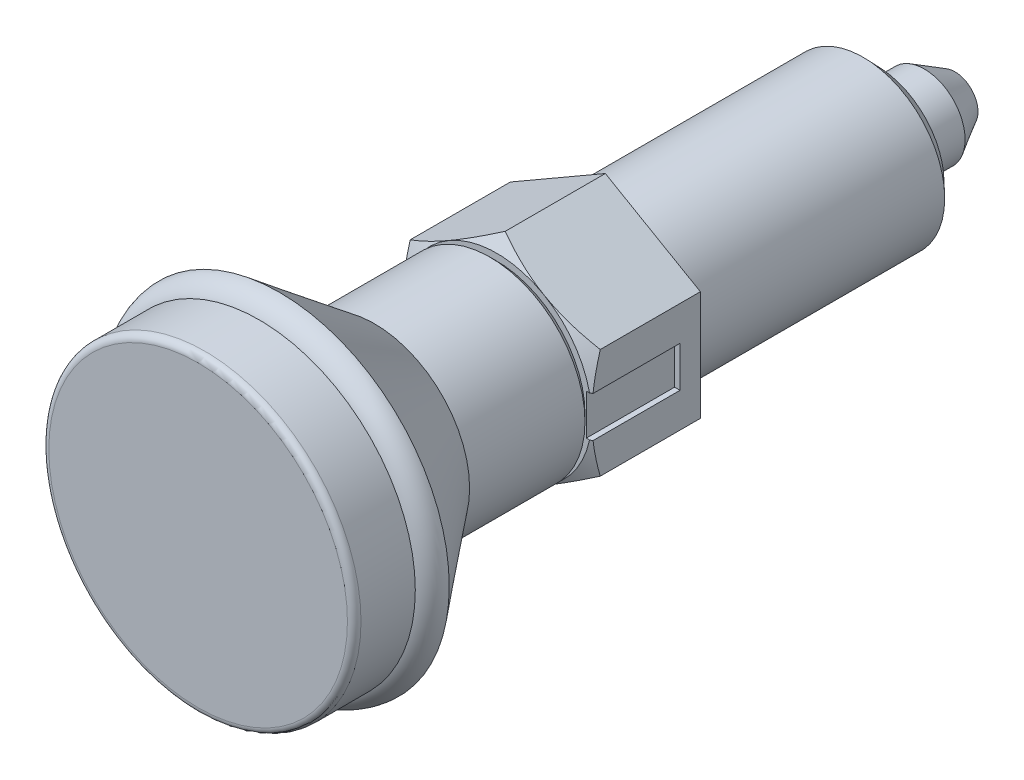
ISO-10303-21;
HEADER;
FILE_DESCRIPTION(('STEP AP214'),'2;1');
FILE_NAME('part.step','',(''),(''),'','','');
FILE_SCHEMA(('AUTOMOTIVE_DESIGN { 1 0 10303 214 1 1 1 1 }'));
ENDSEC;
DATA;
#1=APPLICATION_CONTEXT('core data for automotive mechanical design processes');
#2=APPLICATION_PROTOCOL_DEFINITION('international standard','automotive_design',2000,#1);
#3=PRODUCT_CONTEXT('',#1,'mechanical');
#4=PRODUCT('Part','Part','',(#3));
#5=PRODUCT_RELATED_PRODUCT_CATEGORY('part','',(#4));
#6=PRODUCT_DEFINITION_FORMATION('','',#4);
#7=PRODUCT_DEFINITION_CONTEXT('part definition',#1,'design');
#8=PRODUCT_DEFINITION('design','',#6,#7);
#9=PRODUCT_DEFINITION_SHAPE('','',#8);
#10=(LENGTH_UNIT() NAMED_UNIT(*) SI_UNIT(.MILLI.,.METRE.));
#11=(NAMED_UNIT(*) PLANE_ANGLE_UNIT() SI_UNIT($,.RADIAN.));
#12=(NAMED_UNIT(*) SI_UNIT($,.STERADIAN.) SOLID_ANGLE_UNIT());
#13=UNCERTAINTY_MEASURE_WITH_UNIT(LENGTH_MEASURE(1.E-05),#10,'distance_accuracy_value','');
#14=(GEOMETRIC_REPRESENTATION_CONTEXT(3) GLOBAL_UNCERTAINTY_ASSIGNED_CONTEXT((#13)) GLOBAL_UNIT_ASSIGNED_CONTEXT((#10,
#11,#12)) REPRESENTATION_CONTEXT('',''));
#15=CARTESIAN_POINT('',(0.,0.,0.));
#16=DIRECTION('',(0.,0.,1.));
#17=DIRECTION('',(1.,0.,0.));
#18=AXIS2_PLACEMENT_3D('',#15,#16,#17);
#19=CARTESIAN_POINT('',(0.,0.,7.99999999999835));
#20=DIRECTION('',(0.,0.,-1.));
#21=DIRECTION('',(-1.,0.,0.));
#22=AXIS2_PLACEMENT_3D('',#19,#20,#21);
#23=CONICAL_SURFACE('',#22,6.99999999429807,1.04719755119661);
#24=CARTESIAN_POINT('',(7.,-10.7185259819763,4.6503130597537));
#25=CARTESIAN_POINT('',(7.,-10.4111863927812,4.79883652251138));
#26=CARTESIAN_POINT('',(7.,-10.1031201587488,4.9458835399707));
#27=CARTESIAN_POINT('',(7.,-9.4851414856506,5.23618099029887));
#28=CARTESIAN_POINT('',(7.,-9.17522873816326,5.37943076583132));
#29=CARTESIAN_POINT('',(7.,-8.55148999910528,5.66204468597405));
#30=CARTESIAN_POINT('',(7.,-8.23765176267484,5.80138190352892));
#31=CARTESIAN_POINT('',(7.,-7.60739587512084,6.07407147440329));
#32=CARTESIAN_POINT('',(7.,-7.29097835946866,6.20742413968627));
#33=CARTESIAN_POINT('',(7.,-6.65113230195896,6.46813635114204));
#34=CARTESIAN_POINT('',(7.,-6.32766537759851,6.59540222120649));
#35=CARTESIAN_POINT('',(7.,-5.67691706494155,6.83996662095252));
#36=CARTESIAN_POINT('',(7.,-5.34963525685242,6.95726404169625));
#37=CARTESIAN_POINT('',(7.,-4.69140465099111,7.17873933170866));
#38=CARTESIAN_POINT('',(7.,-4.36046534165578,7.28294509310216));
#39=CARTESIAN_POINT('',(7.,-3.69389387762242,7.47485451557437));
#40=CARTESIAN_POINT('',(7.,-3.35826324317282,7.56256339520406));
#41=CARTESIAN_POINT('',(7.,-2.68202380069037,7.71721463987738));
#42=CARTESIAN_POINT('',(7.,-2.34141369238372,7.78415147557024));
#43=CARTESIAN_POINT('',(7.,-1.82750129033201,7.86562610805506));
#44=CARTESIAN_POINT('',(7.,-1.65567653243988,7.88963098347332));
#45=CARTESIAN_POINT('',(7.,-1.31122142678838,7.93085821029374));
#46=CARTESIAN_POINT('',(7.,-1.13859116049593,7.94808123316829));
#47=CARTESIAN_POINT('',(7.,-0.793853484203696,7.97528126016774));
#48=CARTESIAN_POINT('',(7.,-0.621749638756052,7.98530325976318));
#49=CARTESIAN_POINT('',(7.,-0.277271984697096,7.99804825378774));
#50=CARTESIAN_POINT('',(7.,-0.104898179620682,8.00077134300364));
#51=CARTESIAN_POINT('',(7.,0.239760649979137,7.99885363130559));
#52=CARTESIAN_POINT('',(7.,0.412045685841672,7.99421489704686));
#53=CARTESIAN_POINT('',(7.,0.756270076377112,7.97768889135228));
#54=CARTESIAN_POINT('',(7.,0.928209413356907,7.96580125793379));
#55=CARTESIAN_POINT('',(7.,1.34493742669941,7.92845253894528));
#56=CARTESIAN_POINT('',(7.,1.58940592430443,7.89935949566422));
#57=CARTESIAN_POINT('',(7.,2.07646958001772,7.82813397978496));
#58=CARTESIAN_POINT('',(7.,2.31906420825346,7.78599794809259));
#59=CARTESIAN_POINT('',(7.,2.80217998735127,7.69018088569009));
#60=CARTESIAN_POINT('',(7.,3.04269895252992,7.63648893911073));
#61=CARTESIAN_POINT('',(7.,3.52126228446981,7.51919825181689));
#62=CARTESIAN_POINT('',(7.,3.75930688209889,7.45560044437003));
#63=CARTESIAN_POINT('',(7.,4.23878446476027,7.31835710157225));
#64=CARTESIAN_POINT('',(7.,4.48015747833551,7.24450348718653));
#65=CARTESIAN_POINT('',(7.,4.96035218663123,7.08949909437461));
#66=CARTESIAN_POINT('',(7.,5.19917551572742,7.00835334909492));
#67=CARTESIAN_POINT('',(7.,5.67331254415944,6.8404408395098));
#68=CARTESIAN_POINT('',(7.,5.90863843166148,6.75370828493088));
#69=CARTESIAN_POINT('',(7.,6.37746440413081,6.5751524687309));
#70=CARTESIAN_POINT('',(7.,6.61096370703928,6.48332714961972));
#71=CARTESIAN_POINT('',(7.,6.84361473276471,6.38945923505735));
#72=B_SPLINE_CURVE_WITH_KNOTS('',3,(#24,#25,#26,#27,#28,#29,#30,#31,#32,#33,#34,#35,#36,#37,#38,
#39,#40,#41,#42,#43,#44,#45,#46,#47,#48,#49,#50,#51,#52,#53,#54,#55,#56,#57,#58,#59,#60,#61,#62,
#63,#64,#65,#66,#67,#68,#69,#70,#71),.UNSPECIFIED.,.F.,.F.,(4,2,2,2,2,2,2,2,2,2,2,2,2,2,2,2,2,2,
2,2,2,2,2,4),(0.,1.02405063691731,2.04827740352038,3.07836540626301,4.10839964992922,
5.15107951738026,6.19387522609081,7.23441013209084,8.27461532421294,9.31509717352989,
9.83546471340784,10.3557807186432,10.8728165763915,11.3898457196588,11.906729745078,
12.4236395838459,13.1618088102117,13.9001796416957,14.6392510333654,15.3782528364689,
16.1353691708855,16.8919668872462,17.6443059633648,18.3969512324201),.UNSPECIFIED.);
#73=CARTESIAN_POINT('',(7.,-4.04145188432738,7.37478521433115));
#74=VERTEX_POINT('',#73);
#75=CARTESIAN_POINT('',(7.,-1.5,7.90825295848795));
#76=VERTEX_POINT('',#75);
#77=EDGE_CURVE('E302',#74,#76,#72,.T.);
#78=ORIENTED_EDGE('',*,*,#77,.T.);
#79=CARTESIAN_POINT('',(8.17241147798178,-1.5,7.24428919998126));
#80=CARTESIAN_POINT('',(7.9635457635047,-1.5,7.36289231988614));
#81=CARTESIAN_POINT('',(7.75461997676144,-1.5,7.48138983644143));
#82=CARTESIAN_POINT('',(7.33660774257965,-1.5,7.71809952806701));
#83=CARTESIAN_POINT('',(7.12752129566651,-1.5,7.83631170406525));
#84=CARTESIAN_POINT('',(6.70914554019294,-1.5,8.0723775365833));
#85=CARTESIAN_POINT('',(6.49985623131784,-1.5,8.19023119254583));
#86=CARTESIAN_POINT('',(6.0810046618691,-1.5,8.42545397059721));
#87=CARTESIAN_POINT('',(5.87144240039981,-1.5,8.54282309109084));
#88=CARTESIAN_POINT('',(5.66170914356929,-1.5,8.6598866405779));
#89=B_SPLINE_CURVE_WITH_KNOTS('',3,(#79,#80,#81,#82,#83,#84,#85,#86,#87,#88),.UNSPECIFIED.,.F.,
.F.,(4,2,2,2,4),(0.,0.720572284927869,1.44114222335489,2.16171328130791,2.88228670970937),.UNSPECIFIED.);
#90=CARTESIAN_POINT('',(6.83739715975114,-1.5,7.99999999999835));
#91=VERTEX_POINT('',#90);
#92=EDGE_CURVE('E146',#76,#91,#89,.T.);
#93=ORIENTED_EDGE('',*,*,#92,.T.);
#94=CARTESIAN_POINT('',(0.,0.,7.99999999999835));
#95=DIRECTION('',(0.,0.,1.));
#96=DIRECTION('',(1.,0.,0.));
#97=AXIS2_PLACEMENT_3D('',#94,#95,#96);
#98=CIRCLE('',#97,6.99999999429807);
#99=CARTESIAN_POINT('',(3.5,-6.06217782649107,7.99999999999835));
#100=VERTEX_POINT('',#99);
#101=EDGE_CURVE('E404',#100,#91,#98,.T.);
#102=ORIENTED_EDGE('',*,*,#101,.F.);
#103=CARTESIAN_POINT('',(-0.000200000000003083,-8.0830192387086,7.37471854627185));
#104=CARTESIAN_POINT('',(0.153667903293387,-7.99418356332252,7.42600014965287));
#105=CARTESIAN_POINT('',(0.308109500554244,-7.90501666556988,7.47495440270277));
#106=CARTESIAN_POINT('',(0.618246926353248,-7.72595873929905,7.56756720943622));
#107=CARTESIAN_POINT('',(0.773943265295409,-7.63606741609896,7.61122347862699));
#108=CARTESIAN_POINT('',(1.24352516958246,-7.36495417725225,7.73338840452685));
#109=CARTESIAN_POINT('',(1.55926433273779,-7.18266208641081,7.80287443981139));
#110=CARTESIAN_POINT('',(2.03176224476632,-6.90986528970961,7.88435504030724));
#111=CARTESIAN_POINT('',(2.18710922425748,-6.82017566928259,7.90756651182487));
#112=CARTESIAN_POINT('',(2.49850511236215,-6.64039116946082,7.94648878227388));
#113=CARTESIAN_POINT('',(2.6545539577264,-6.55029632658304,7.96220024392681));
#114=CARTESIAN_POINT('',(2.96692267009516,-6.36995016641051,7.98572208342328));
#115=CARTESIAN_POINT('',(3.12324202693,-6.27969914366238,7.99354142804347));
#116=CARTESIAN_POINT('',(3.43601650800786,-6.09911871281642,8.00111975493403));
#117=CARTESIAN_POINT('',(3.59247162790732,-6.00878930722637,8.00087898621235));
#118=CARTESIAN_POINT('',(4.02110687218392,-5.76131663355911,7.98914026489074));
#119=CARTESIAN_POINT('',(4.29314668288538,-5.60425437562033,7.96943425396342));
#120=CARTESIAN_POINT('',(4.83541944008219,-5.29117305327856,7.90694653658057));
#121=CARTESIAN_POINT('',(5.10565047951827,-5.13515508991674,7.86414347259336));
#122=CARTESIAN_POINT('',(5.64901454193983,-4.82144370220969,7.75714831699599));
#123=CARTESIAN_POINT('',(5.92207900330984,-4.66378986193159,7.69250290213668));
#124=CARTESIAN_POINT('',(6.46413578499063,-4.35083323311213,7.54578392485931));
#125=CARTESIAN_POINT('',(6.73313504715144,-4.19552643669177,7.46374482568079));
#126=CARTESIAN_POINT('',(7.0002,-4.04133641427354,7.37471854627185));
#127=B_SPLINE_CURVE_WITH_KNOTS('',3,(#103,#104,#105,#106,#107,#108,#109,#110,#111,#112,#113,
#114,#115,#116,#117,#118,#119,#120,#121,#122,#123,#124,#125,#126),.UNSPECIFIED.,.F.,.F.,(4,2,2,
2,2,2,2,2,2,2,2,4),(0.,0.554727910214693,1.10969417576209,2.22193274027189,2.76443041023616,
3.30688013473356,3.84871284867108,4.39052882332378,5.33376515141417,6.27787517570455,
7.2429241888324,8.20607866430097),.UNSPECIFIED.);
#128=EDGE_CURVE('E294',#100,#74,#127,.T.);
#129=ORIENTED_EDGE('',*,*,#128,.T.);
#130=EDGE_LOOP('',(#78,#93,#102,#129));
#131=FACE_BOUND('',#130,.T.);
#132=ADVANCED_FACE('F14',(#131),#23,.T.);
#133=CARTESIAN_POINT('',(6.83739715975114,1.5,7.99999999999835));
#134=VERTEX_POINT('',#133);
#135=CARTESIAN_POINT('',(3.5,6.06217782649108,7.99999999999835));
#136=VERTEX_POINT('',#135);
#137=EDGE_CURVE('E407',#134,#136,#98,.T.);
#138=ORIENTED_EDGE('',*,*,#137,.F.);
#139=CARTESIAN_POINT('',(5.66170914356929,1.5,8.6598866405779));
#140=CARTESIAN_POINT('',(5.87144240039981,1.5,8.54282309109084));
#141=CARTESIAN_POINT('',(6.0810046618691,1.5,8.42545397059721));
#142=CARTESIAN_POINT('',(6.49985623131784,1.5,8.19023119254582));
#143=CARTESIAN_POINT('',(6.70914554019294,1.5,8.0723775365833));
#144=CARTESIAN_POINT('',(7.12752129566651,1.5,7.83631170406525));
#145=CARTESIAN_POINT('',(7.33660774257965,1.5,7.71809952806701));
#146=CARTESIAN_POINT('',(7.75461997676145,1.5,7.48138983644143));
#147=CARTESIAN_POINT('',(7.96354576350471,1.5,7.36289231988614));
#148=CARTESIAN_POINT('',(8.17241147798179,1.5,7.24428919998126));
#149=B_SPLINE_CURVE_WITH_KNOTS('',3,(#139,#140,#141,#142,#143,#144,#145,#146,#147,#148),
.UNSPECIFIED.,.F.,.F.,(4,2,2,2,4),(0.,0.720573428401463,1.44114448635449,2.16171442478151,
2.88228670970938),.UNSPECIFIED.);
#150=CARTESIAN_POINT('',(7.,1.5,7.90825295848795));
#151=VERTEX_POINT('',#150);
#152=EDGE_CURVE('E154',#134,#151,#149,.T.);
#153=ORIENTED_EDGE('',*,*,#152,.T.);
#154=CARTESIAN_POINT('',(7.,4.04145188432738,7.37478521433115));
#155=VERTEX_POINT('',#154);
#156=EDGE_CURVE('E270',#151,#155,#72,.T.);
#157=ORIENTED_EDGE('',*,*,#156,.T.);
#158=CARTESIAN_POINT('',(7.0002,4.04133641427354,7.37471854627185));
#159=CARTESIAN_POINT('',(6.84633209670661,4.13017208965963,7.42600014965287));
#160=CARTESIAN_POINT('',(6.69189049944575,4.21933898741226,7.47495440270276));
#161=CARTESIAN_POINT('',(6.38175307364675,4.39839691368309,7.56756720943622));
#162=CARTESIAN_POINT('',(6.22605673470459,4.48828823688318,7.61122347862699));
#163=CARTESIAN_POINT('',(5.75647483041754,4.75940147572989,7.73338840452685));
#164=CARTESIAN_POINT('',(5.4407356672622,4.94169356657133,7.80287443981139));
#165=CARTESIAN_POINT('',(4.96823775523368,5.21449036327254,7.88435504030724));
#166=CARTESIAN_POINT('',(4.81289077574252,5.30417998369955,7.90756651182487));
#167=CARTESIAN_POINT('',(4.50149488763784,5.48396448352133,7.94648878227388));
#168=CARTESIAN_POINT('',(4.3454460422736,5.57405932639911,7.96220024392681));
#169=CARTESIAN_POINT('',(4.03307732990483,5.75440548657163,7.98572208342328));
#170=CARTESIAN_POINT('',(3.87675797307,5.84465650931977,7.99354142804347));
#171=CARTESIAN_POINT('',(3.56398349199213,6.02523694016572,8.00111975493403));
#172=CARTESIAN_POINT('',(3.40752837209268,6.11556634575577,8.00087898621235));
#173=CARTESIAN_POINT('',(2.97889312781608,6.36303901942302,7.98914026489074));
#174=CARTESIAN_POINT('',(2.70685331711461,6.52010127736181,7.96943425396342));
#175=CARTESIAN_POINT('',(2.16458055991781,6.83318259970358,7.90694653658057));
#176=CARTESIAN_POINT('',(1.89434952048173,6.9892005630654,7.86414347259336));
#177=CARTESIAN_POINT('',(1.35098545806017,7.30291195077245,7.75714831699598));
#178=CARTESIAN_POINT('',(1.07792099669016,7.46056579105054,7.69250290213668));
#179=CARTESIAN_POINT('',(0.535864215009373,7.77352241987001,7.54578392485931));
#180=CARTESIAN_POINT('',(0.266864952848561,7.92882921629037,7.46374482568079));
#181=CARTESIAN_POINT('',(-0.000199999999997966,8.0830192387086,7.37471854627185));
#182=B_SPLINE_CURVE_WITH_KNOTS('',3,(#158,#159,#160,#161,#162,#163,#164,#165,#166,#167,#168,
#169,#170,#171,#172,#173,#174,#175,#176,#177,#178,#179,#180,#181),.UNSPECIFIED.,.F.,.F.,(4,2,2,
2,2,2,2,2,2,2,2,4),(0.,0.554727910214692,1.10969417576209,2.22193274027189,2.76443041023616,
3.30688013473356,3.84871284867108,4.39052882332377,5.33376515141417,6.27787517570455,
7.24292418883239,8.20607866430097),.UNSPECIFIED.);
#183=EDGE_CURVE('E269',#155,#136,#182,.T.);
#184=ORIENTED_EDGE('',*,*,#183,.T.);
#185=EDGE_LOOP('',(#138,#153,#157,#184));
#186=FACE_BOUND('',#185,.T.);
#187=ADVANCED_FACE('F368',(#186),#23,.T.);
#188=CARTESIAN_POINT('',(0.,6.99999999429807,7.99999999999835));
#189=DIRECTION('',(0.,0.,1.));
#190=DIRECTION('',(1.,0.,0.));
#191=AXIS2_PLACEMENT_3D('',#188,#189,#190);
#192=PLANE('',#191);
#193=CARTESIAN_POINT('',(0.,0.,7.99999999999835));
#194=DIRECTION('',(0.,0.,1.));
#195=DIRECTION('',(1.,0.,0.));
#196=AXIS2_PLACEMENT_3D('',#193,#194,#195);
#197=CIRCLE('',#196,6.49999999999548);
#198=CARTESIAN_POINT('',(6.49999999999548,0.,7.99999999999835));
#199=VERTEX_POINT('',#198);
#200=EDGE_CURVE('E417',#199,#199,#197,.T.);
#201=ORIENTED_EDGE('',*,*,#200,.F.);
#202=EDGE_LOOP('',(#201));
#203=FACE_BOUND('',#202,.T.);
#204=ORIENTED_EDGE('',*,*,#101,.T.);
#205=DIRECTION('',(1.,0.,0.));
#206=VECTOR('',#205,1.);
#207=CARTESIAN_POINT('',(6.6,-1.5,7.99999999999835));
#208=LINE('',#207,#206);
#209=CARTESIAN_POINT('',(6.6,-1.5,7.99999999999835));
#210=VERTEX_POINT('',#209);
#211=EDGE_CURVE('E155',#210,#91,#208,.T.);
#212=ORIENTED_EDGE('',*,*,#211,.F.);
#213=DIRECTION('',(0.,1.,0.));
#214=VECTOR('',#213,1.);
#215=CARTESIAN_POINT('',(6.6,-1.5,7.99999999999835));
#216=LINE('',#215,#214);
#217=CARTESIAN_POINT('',(6.6,1.5,7.99999999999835));
#218=VERTEX_POINT('',#217);
#219=EDGE_CURVE('E164',#210,#218,#216,.T.);
#220=ORIENTED_EDGE('',*,*,#219,.T.);
#221=DIRECTION('',(1.,0.,0.));
#222=VECTOR('',#221,1.);
#223=CARTESIAN_POINT('',(6.6,1.5,7.99999999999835));
#224=LINE('',#223,#222);
#225=EDGE_CURVE('E171',#218,#134,#224,.T.);
#226=ORIENTED_EDGE('',*,*,#225,.T.);
#227=ORIENTED_EDGE('',*,*,#137,.T.);
#228=CARTESIAN_POINT('',(-3.5,6.06217782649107,7.99999999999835));
#229=VERTEX_POINT('',#228);
#230=EDGE_CURVE('E412',#136,#229,#98,.T.);
#231=ORIENTED_EDGE('',*,*,#230,.T.);
#232=CARTESIAN_POINT('',(-6.83739715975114,1.5,7.99999999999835));
#233=VERTEX_POINT('',#232);
#234=EDGE_CURVE('E406',#229,#233,#98,.T.);
#235=ORIENTED_EDGE('',*,*,#234,.T.);
#236=DIRECTION('',(-1.,0.,0.));
#237=VECTOR('',#236,1.);
#238=CARTESIAN_POINT('',(-6.6,1.5,7.99999999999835));
#239=LINE('',#238,#237);
#240=CARTESIAN_POINT('',(-6.6,1.5,7.99999999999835));
#241=VERTEX_POINT('',#240);
#242=EDGE_CURVE('E450',#241,#233,#239,.T.);
#243=ORIENTED_EDGE('',*,*,#242,.F.);
#244=DIRECTION('',(0.,1.,0.));
#245=VECTOR('',#244,1.);
#246=CARTESIAN_POINT('',(-6.6,-1.5,7.99999999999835));
#247=LINE('',#246,#245);
#248=CARTESIAN_POINT('',(-6.6,-1.5,7.99999999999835));
#249=VERTEX_POINT('',#248);
#250=EDGE_CURVE('E461',#249,#241,#247,.T.);
#251=ORIENTED_EDGE('',*,*,#250,.F.);
#252=DIRECTION('',(-1.,0.,0.));
#253=VECTOR('',#252,1.);
#254=CARTESIAN_POINT('',(-6.6,-1.5,7.99999999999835));
#255=LINE('',#254,#253);
#256=CARTESIAN_POINT('',(-6.83739715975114,-1.5,7.99999999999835));
#257=VERTEX_POINT('',#256);
#258=EDGE_CURVE('E467',#249,#257,#255,.T.);
#259=ORIENTED_EDGE('',*,*,#258,.T.);
#260=CARTESIAN_POINT('',(-3.5,-6.06217782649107,7.99999999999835));
#261=VERTEX_POINT('',#260);
#262=EDGE_CURVE('E403',#257,#261,#98,.T.);
#263=ORIENTED_EDGE('',*,*,#262,.T.);
#264=EDGE_CURVE('E398',#261,#100,#98,.T.);
#265=ORIENTED_EDGE('',*,*,#264,.T.);
#266=EDGE_LOOP('',(#204,#212,#220,#226,#227,#231,#235,#243,#251,#259,#263,#265));
#267=FACE_BOUND('',#266,.T.);
#268=ADVANCED_FACE('F286',(#203,#267),#192,.T.);
#269=CARTESIAN_POINT('',(7.,4.04145188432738,29.3853532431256));
#270=DIRECTION('',(1.,0.,0.));
#271=DIRECTION('',(0.,1.,0.));
#272=AXIS2_PLACEMENT_3D('',#269,#270,#271);
#273=PLANE('',#272);
#274=DIRECTION('',(0.,-1.,0.));
#275=VECTOR('',#274,1.);
#276=CARTESIAN_POINT('',(7.,1.5,1.49999999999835));
#277=LINE('',#276,#275);
#278=CARTESIAN_POINT('',(7.,1.5,1.49999999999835));
#279=VERTEX_POINT('',#278);
#280=CARTESIAN_POINT('',(7.,-1.5,1.49999999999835));
#281=VERTEX_POINT('',#280);
#282=EDGE_CURVE('E29',#279,#281,#277,.T.);
#283=ORIENTED_EDGE('',*,*,#282,.T.);
#284=DIRECTION('',(0.,0.,1.));
#285=VECTOR('',#284,1.);
#286=CARTESIAN_POINT('',(7.,-1.5,1.49999999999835));
#287=LINE('',#286,#285);
#288=EDGE_CURVE('E142',#281,#76,#287,.T.);
#289=ORIENTED_EDGE('',*,*,#288,.T.);
#290=ORIENTED_EDGE('',*,*,#77,.F.);
#291=DIRECTION('',(0.,0.,-1.));
#292=VECTOR('',#291,1.);
#293=CARTESIAN_POINT('',(7.,-4.04145188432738,29.3853532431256));
#294=LINE('',#293,#292);
#295=CARTESIAN_POINT('',(7.,-4.04145188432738,0.));
#296=VERTEX_POINT('',#295);
#297=EDGE_CURVE('E239',#74,#296,#294,.T.);
#298=ORIENTED_EDGE('',*,*,#297,.T.);
#299=DIRECTION('',(0.,-1.,0.));
#300=VECTOR('',#299,1.);
#301=CARTESIAN_POINT('',(7.,4.04145188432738,0.));
#302=LINE('',#301,#300);
#303=CARTESIAN_POINT('',(7.00000000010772,4.04145188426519,0.));
#304=VERTEX_POINT('',#303);
#305=EDGE_CURVE('E244',#304,#296,#302,.T.);
#306=ORIENTED_EDGE('',*,*,#305,.F.);
#307=DIRECTION('',(0.,0.,-1.));
#308=VECTOR('',#307,1.);
#309=CARTESIAN_POINT('',(7.,4.04145188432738,29.3853532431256));
#310=LINE('',#309,#308);
#311=EDGE_CURVE('E243',#155,#304,#310,.T.);
#312=ORIENTED_EDGE('',*,*,#311,.F.);
#313=ORIENTED_EDGE('',*,*,#156,.F.);
#314=DIRECTION('',(0.,0.,-1.));
#315=VECTOR('',#314,1.);
#316=CARTESIAN_POINT('',(7.,1.5,29.3853532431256));
#317=LINE('',#316,#315);
#318=EDGE_CURVE('E9',#151,#279,#317,.T.);
#319=ORIENTED_EDGE('',*,*,#318,.T.);
#320=EDGE_LOOP('',(#283,#289,#290,#298,#306,#312,#313,#319));
#321=FACE_BOUND('',#320,.T.);
#322=ADVANCED_FACE('F157',(#321),#273,.T.);
#323=CARTESIAN_POINT('',(-1.07712016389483E-10,8.08290376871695,7.37478521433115));
#324=VERTEX_POINT('',#323);
#325=EDGE_CURVE('E251',#136,#324,#182,.T.);
#326=ORIENTED_EDGE('',*,*,#325,.T.);
#327=CARTESIAN_POINT('',(0.000200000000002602,8.0830192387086,7.37471854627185));
#328=CARTESIAN_POINT('',(-0.153667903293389,7.99418356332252,7.42600014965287));
#329=CARTESIAN_POINT('',(-0.308109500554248,7.90501666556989,7.47495440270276));
#330=CARTESIAN_POINT('',(-0.618246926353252,7.72595873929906,7.56756720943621));
#331=CARTESIAN_POINT('',(-0.773943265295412,7.63606741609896,7.61122347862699));
#332=CARTESIAN_POINT('',(-1.24352516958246,7.36495417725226,7.73338840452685));
#333=CARTESIAN_POINT('',(-1.5592643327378,7.18266208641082,7.80287443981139));
#334=CARTESIAN_POINT('',(-2.03176224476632,6.90986528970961,7.88435504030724));
#335=CARTESIAN_POINT('',(-2.18710922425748,6.8201756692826,7.90756651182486));
#336=CARTESIAN_POINT('',(-2.49850511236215,6.64039116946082,7.94648878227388));
#337=CARTESIAN_POINT('',(-2.6545539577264,6.55029632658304,7.96220024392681));
#338=CARTESIAN_POINT('',(-2.96692267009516,6.36995016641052,7.98572208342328));
#339=CARTESIAN_POINT('',(-3.12324202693,6.27969914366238,7.99354142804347));
#340=CARTESIAN_POINT('',(-3.43601650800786,6.09911871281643,8.00111975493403));
#341=CARTESIAN_POINT('',(-3.59247162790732,6.00878930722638,8.00087898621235));
#342=CARTESIAN_POINT('',(-4.02110687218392,5.76131663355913,7.98914026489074));
#343=CARTESIAN_POINT('',(-4.29314668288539,5.60425437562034,7.96943425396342));
#344=CARTESIAN_POINT('',(-4.83541944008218,5.29117305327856,7.90694653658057));
#345=CARTESIAN_POINT('',(-5.10565047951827,5.13515508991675,7.86414347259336));
#346=CARTESIAN_POINT('',(-5.64901454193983,4.82144370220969,7.75714831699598));
#347=CARTESIAN_POINT('',(-5.92207900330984,4.6637898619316,7.69250290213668));
#348=CARTESIAN_POINT('',(-6.46413578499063,4.35083323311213,7.54578392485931));
#349=CARTESIAN_POINT('',(-6.73313504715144,4.19552643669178,7.46374482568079));
#350=CARTESIAN_POINT('',(-7.0002,4.04133641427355,7.37471854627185));
#351=B_SPLINE_CURVE_WITH_KNOTS('',3,(#327,#328,#329,#330,#331,#332,#333,#334,#335,#336,#337,
#338,#339,#340,#341,#342,#343,#344,#345,#346,#347,#348,#349,#350),.UNSPECIFIED.,.F.,.F.,(4,2,2,
2,2,2,2,2,2,2,2,4),(0.,0.554727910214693,1.10969417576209,2.22193274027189,2.76443041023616,
3.30688013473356,3.84871284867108,4.39052882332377,5.33376515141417,6.27787517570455,
7.24292418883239,8.20607866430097),.UNSPECIFIED.);
#352=EDGE_CURVE('E494',#324,#229,#351,.T.);
#353=ORIENTED_EDGE('',*,*,#352,.T.);
#354=ORIENTED_EDGE('',*,*,#230,.F.);
#355=EDGE_LOOP('',(#326,#353,#354));
#356=FACE_BOUND('',#355,.T.);
#357=ADVANCED_FACE('F189',(#356),#23,.T.);
#358=CARTESIAN_POINT('',(-5.66170914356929,1.5,8.6598866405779));
#359=CARTESIAN_POINT('',(-5.87144240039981,1.5,8.54282309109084));
#360=CARTESIAN_POINT('',(-6.0810046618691,1.5,8.42545397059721));
#361=CARTESIAN_POINT('',(-6.49985623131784,1.5,8.19023119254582));
#362=CARTESIAN_POINT('',(-6.70914554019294,1.5,8.0723775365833));
#363=CARTESIAN_POINT('',(-7.12752129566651,1.5,7.83631170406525));
#364=CARTESIAN_POINT('',(-7.33660774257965,1.5,7.71809952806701));
#365=CARTESIAN_POINT('',(-7.75461997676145,1.5,7.48138983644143));
#366=CARTESIAN_POINT('',(-7.96354576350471,1.5,7.36289231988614));
#367=CARTESIAN_POINT('',(-8.17241147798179,1.5,7.24428919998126));
#368=B_SPLINE_CURVE_WITH_KNOTS('',3,(#358,#359,#360,#361,#362,#363,#364,#365,#366,#367),
.UNSPECIFIED.,.F.,.F.,(4,2,2,2,4),(0.,0.720573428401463,1.44114448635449,2.16171442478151,
2.88228670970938),.UNSPECIFIED.);
#369=CARTESIAN_POINT('',(-7.,1.5,7.90825295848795));
#370=VERTEX_POINT('',#369);
#371=EDGE_CURVE('E217',#233,#370,#368,.T.);
#372=ORIENTED_EDGE('',*,*,#371,.F.);
#373=ORIENTED_EDGE('',*,*,#234,.F.);
#374=CARTESIAN_POINT('',(-7.,4.04145188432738,7.37478521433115));
#375=VERTEX_POINT('',#374);
#376=EDGE_CURVE('E318',#229,#375,#351,.T.);
#377=ORIENTED_EDGE('',*,*,#376,.T.);
#378=CARTESIAN_POINT('',(-7.,-10.7185259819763,4.6503130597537));
#379=CARTESIAN_POINT('',(-7.,-10.4111863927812,4.79883652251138));
#380=CARTESIAN_POINT('',(-7.,-10.1031201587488,4.9458835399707));
#381=CARTESIAN_POINT('',(-7.,-9.4851414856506,5.23618099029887));
#382=CARTESIAN_POINT('',(-7.,-9.17522873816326,5.37943076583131));
#383=CARTESIAN_POINT('',(-7.,-8.55148999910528,5.66204468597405));
#384=CARTESIAN_POINT('',(-7.,-8.23765176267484,5.80138190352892));
#385=CARTESIAN_POINT('',(-7.,-7.60739587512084,6.07407147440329));
#386=CARTESIAN_POINT('',(-7.,-7.29097835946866,6.20742413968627));
#387=CARTESIAN_POINT('',(-7.,-6.65113230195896,6.46813635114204));
#388=CARTESIAN_POINT('',(-7.,-6.32766537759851,6.59540222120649));
#389=CARTESIAN_POINT('',(-7.,-5.67691706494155,6.83996662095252));
#390=CARTESIAN_POINT('',(-7.,-5.34963525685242,6.95726404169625));
#391=CARTESIAN_POINT('',(-7.,-4.69140465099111,7.17873933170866));
#392=CARTESIAN_POINT('',(-7.,-4.36046534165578,7.28294509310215));
#393=CARTESIAN_POINT('',(-7.,-3.69389387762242,7.47485451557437));
#394=CARTESIAN_POINT('',(-7.,-3.35826324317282,7.56256339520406));
#395=CARTESIAN_POINT('',(-7.,-2.68202380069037,7.71721463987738));
#396=CARTESIAN_POINT('',(-7.,-2.34141369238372,7.78415147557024));
#397=CARTESIAN_POINT('',(-7.,-1.82750129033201,7.86562610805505));
#398=CARTESIAN_POINT('',(-7.,-1.65567653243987,7.88963098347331));
#399=CARTESIAN_POINT('',(-7.,-1.31122142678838,7.93085821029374));
#400=CARTESIAN_POINT('',(-7.,-1.13859116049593,7.94808123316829));
#401=CARTESIAN_POINT('',(-7.,-0.793853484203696,7.97528126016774));
#402=CARTESIAN_POINT('',(-7.,-0.621749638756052,7.98530325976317));
#403=CARTESIAN_POINT('',(-7.,-0.277271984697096,7.99804825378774));
#404=CARTESIAN_POINT('',(-7.,-0.104898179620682,8.00077134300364));
#405=CARTESIAN_POINT('',(-7.,0.239760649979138,7.99885363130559));
#406=CARTESIAN_POINT('',(-7.,0.412045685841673,7.99421489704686));
#407=CARTESIAN_POINT('',(-7.,0.756270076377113,7.97768889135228));
#408=CARTESIAN_POINT('',(-7.,0.928209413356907,7.96580125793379));
#409=CARTESIAN_POINT('',(-7.,1.34493742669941,7.92845253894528));
#410=CARTESIAN_POINT('',(-7.,1.58940592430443,7.89935949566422));
#411=CARTESIAN_POINT('',(-7.,2.07646958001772,7.82813397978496));
#412=CARTESIAN_POINT('',(-7.,2.31906420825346,7.78599794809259));
#413=CARTESIAN_POINT('',(-7.,2.80217998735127,7.69018088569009));
#414=CARTESIAN_POINT('',(-7.,3.04269895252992,7.63648893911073));
#415=CARTESIAN_POINT('',(-7.,3.52126228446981,7.51919825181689));
#416=CARTESIAN_POINT('',(-7.,3.75930688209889,7.45560044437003));
#417=CARTESIAN_POINT('',(-7.,4.23878446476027,7.31835710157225));
#418=CARTESIAN_POINT('',(-7.,4.48015747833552,7.24450348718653));
#419=CARTESIAN_POINT('',(-7.,4.96035218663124,7.08949909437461));
#420=CARTESIAN_POINT('',(-7.,5.19917551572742,7.00835334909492));
#421=CARTESIAN_POINT('',(-7.,5.67331254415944,6.8404408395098));
#422=CARTESIAN_POINT('',(-7.,5.90863843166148,6.75370828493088));
#423=CARTESIAN_POINT('',(-7.,6.37746440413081,6.5751524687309));
#424=CARTESIAN_POINT('',(-7.,6.61096370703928,6.48332714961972));
#425=CARTESIAN_POINT('',(-7.,6.84361473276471,6.38945923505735));
#426=B_SPLINE_CURVE_WITH_KNOTS('',3,(#378,#379,#380,#381,#382,#383,#384,#385,#386,#387,#388,
#389,#390,#391,#392,#393,#394,#395,#396,#397,#398,#399,#400,#401,#402,#403,#404,#405,#406,#407,
#408,#409,#410,#411,#412,#413,#414,#415,#416,#417,#418,#419,#420,#421,#422,#423,#424,#425),
.UNSPECIFIED.,.F.,.F.,(4,2,2,2,2,2,2,2,2,2,2,2,2,2,2,2,2,2,2,2,2,2,2,4),(0.,1.02405063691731,
2.04827740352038,3.07836540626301,4.10839964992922,5.15107951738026,6.19387522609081,
7.23441013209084,8.27461532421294,9.31509717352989,9.83546471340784,10.3557807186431,
10.8728165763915,11.3898457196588,11.906729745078,12.4236395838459,13.1618088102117,
13.9001796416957,14.6392510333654,15.3782528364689,16.1353691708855,16.8919668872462,
17.6443059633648,18.39695123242),.UNSPECIFIED.);
#427=EDGE_CURVE('E317',#375,#370,#426,.F.);
#428=ORIENTED_EDGE('',*,*,#427,.T.);
#429=EDGE_LOOP('',(#372,#373,#377,#428));
#430=FACE_BOUND('',#429,.T.);
#431=ADVANCED_FACE('F375',(#430),#23,.T.);
#432=CARTESIAN_POINT('',(-8.17241147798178,-1.5,7.24428919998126));
#433=CARTESIAN_POINT('',(-7.9635457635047,-1.5,7.36289231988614));
#434=CARTESIAN_POINT('',(-7.75461997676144,-1.5,7.48138983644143));
#435=CARTESIAN_POINT('',(-7.33660774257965,-1.5,7.71809952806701));
#436=CARTESIAN_POINT('',(-7.12752129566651,-1.5,7.83631170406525));
#437=CARTESIAN_POINT('',(-6.70914554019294,-1.5,8.0723775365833));
#438=CARTESIAN_POINT('',(-6.49985623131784,-1.5,8.19023119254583));
#439=CARTESIAN_POINT('',(-6.0810046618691,-1.5,8.42545397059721));
#440=CARTESIAN_POINT('',(-5.87144240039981,-1.5,8.54282309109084));
#441=CARTESIAN_POINT('',(-5.66170914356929,-1.5,8.6598866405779));
#442=B_SPLINE_CURVE_WITH_KNOTS('',3,(#432,#433,#434,#435,#436,#437,#438,#439,#440,#441),
.UNSPECIFIED.,.F.,.F.,(4,2,2,2,4),(0.,0.720572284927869,1.44114222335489,2.16171328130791,
2.88228670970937),.UNSPECIFIED.);
#443=CARTESIAN_POINT('',(-7.,-1.5,7.90825295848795));
#444=VERTEX_POINT('',#443);
#445=EDGE_CURVE('E225',#444,#257,#442,.T.);
#446=ORIENTED_EDGE('',*,*,#445,.F.);
#447=CARTESIAN_POINT('',(-7.,-4.04145188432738,7.37478521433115));
#448=VERTEX_POINT('',#447);
#449=EDGE_CURVE('E311',#444,#448,#426,.F.);
#450=ORIENTED_EDGE('',*,*,#449,.T.);
#451=CARTESIAN_POINT('',(-7.0002,-4.04133641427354,7.37471854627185));
#452=CARTESIAN_POINT('',(-6.84633209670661,-4.13017208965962,7.42600014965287));
#453=CARTESIAN_POINT('',(-6.69189049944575,-4.21933898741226,7.47495440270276));
#454=CARTESIAN_POINT('',(-6.38175307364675,-4.39839691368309,7.56756720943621));
#455=CARTESIAN_POINT('',(-6.22605673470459,-4.48828823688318,7.61122347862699));
#456=CARTESIAN_POINT('',(-5.75647483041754,-4.75940147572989,7.73338840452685));
#457=CARTESIAN_POINT('',(-5.4407356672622,-4.94169356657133,7.80287443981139));
#458=CARTESIAN_POINT('',(-4.96823775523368,-5.21449036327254,7.88435504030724));
#459=CARTESIAN_POINT('',(-4.81289077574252,-5.30417998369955,7.90756651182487));
#460=CARTESIAN_POINT('',(-4.50149488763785,-5.48396448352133,7.94648878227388));
#461=CARTESIAN_POINT('',(-4.3454460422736,-5.5740593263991,7.96220024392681));
#462=CARTESIAN_POINT('',(-4.03307732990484,-5.75440548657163,7.98572208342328));
#463=CARTESIAN_POINT('',(-3.87675797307,-5.84465650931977,7.99354142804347));
#464=CARTESIAN_POINT('',(-3.56398349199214,-6.02523694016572,8.00111975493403));
#465=CARTESIAN_POINT('',(-3.40752837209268,-6.11556634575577,8.00087898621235));
#466=CARTESIAN_POINT('',(-2.97889312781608,-6.36303901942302,7.98914026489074));
#467=CARTESIAN_POINT('',(-2.70685331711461,-6.52010127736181,7.96943425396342));
#468=CARTESIAN_POINT('',(-2.16458055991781,-6.83318259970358,7.90694653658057));
#469=CARTESIAN_POINT('',(-1.89434952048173,-6.9892005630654,7.86414347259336));
#470=CARTESIAN_POINT('',(-1.35098545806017,-7.30291195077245,7.75714831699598));
#471=CARTESIAN_POINT('',(-1.07792099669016,-7.46056579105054,7.69250290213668));
#472=CARTESIAN_POINT('',(-0.535864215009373,-7.77352241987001,7.54578392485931));
#473=CARTESIAN_POINT('',(-0.266864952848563,-7.92882921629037,7.46374482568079));
#474=CARTESIAN_POINT('',(0.000199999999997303,-8.0830192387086,7.37471854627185));
#475=B_SPLINE_CURVE_WITH_KNOTS('',3,(#451,#452,#453,#454,#455,#456,#457,#458,#459,#460,#461,
#462,#463,#464,#465,#466,#467,#468,#469,#470,#471,#472,#473,#474),.UNSPECIFIED.,.F.,.F.,(4,2,2,
2,2,2,2,2,2,2,2,4),(0.,0.554727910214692,1.10969417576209,2.22193274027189,2.76443041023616,
3.30688013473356,3.84871284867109,4.39052882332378,5.33376515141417,6.27787517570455,
7.24292418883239,8.20607866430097),.UNSPECIFIED.);
#476=EDGE_CURVE('E310',#448,#261,#475,.T.);
#477=ORIENTED_EDGE('',*,*,#476,.T.);
#478=ORIENTED_EDGE('',*,*,#262,.F.);
#479=EDGE_LOOP('',(#446,#450,#477,#478));
#480=FACE_BOUND('',#479,.T.);
#481=ADVANCED_FACE('F383',(#480),#23,.T.);
#482=ORIENTED_EDGE('',*,*,#264,.F.);
#483=CARTESIAN_POINT('',(0.,-8.08290376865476,7.37478521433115));
#484=VERTEX_POINT('',#483);
#485=EDGE_CURVE('E303',#261,#484,#475,.T.);
#486=ORIENTED_EDGE('',*,*,#485,.T.);
#487=EDGE_CURVE('E301',#484,#100,#127,.T.);
#488=ORIENTED_EDGE('',*,*,#487,.T.);
#489=EDGE_LOOP('',(#482,#486,#488));
#490=FACE_BOUND('',#489,.T.);
#491=ADVANCED_FACE('F378',(#490),#23,.T.);
#492=CARTESIAN_POINT('',(0.,10.9999999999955,29.9999999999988));
#493=DIRECTION('',(0.,0.,1.));
#494=DIRECTION('',(1.,0.,0.));
#495=AXIS2_PLACEMENT_3D('',#492,#493,#494);
#496=PLANE('',#495);
#497=CARTESIAN_POINT('',(0.,0.,29.9999999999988));
#498=DIRECTION('',(0.,0.,1.));
#499=DIRECTION('',(1.,0.,0.));
#500=AXIS2_PLACEMENT_3D('',#497,#498,#499);
#501=CIRCLE('',#500,10.9999999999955);
#502=CARTESIAN_POINT('',(10.9999999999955,0.,29.9999999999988));
#503=VERTEX_POINT('',#502);
#504=EDGE_CURVE('E439',#503,#503,#501,.T.);
#505=ORIENTED_EDGE('',*,*,#504,.T.);
#506=EDGE_LOOP('',(#505));
#507=FACE_BOUND('',#506,.T.);
#508=ADVANCED_FACE('F16',(#507),#496,.T.);
#509=CARTESIAN_POINT('',(0.,0.,29.4999999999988));
#510=DIRECTION('',(0.,0.,1.));
#511=DIRECTION('',(1.,0.,0.));
#512=AXIS2_PLACEMENT_3D('',#509,#510,#511);
#513=TOROIDAL_SURFACE('',#512,10.9999999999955,0.5);
#514=CARTESIAN_POINT('',(0.,0.,29.4999999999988));
#515=DIRECTION('',(0.,0.,1.));
#516=DIRECTION('',(1.,0.,0.));
#517=AXIS2_PLACEMENT_3D('',#514,#515,#516);
#518=CIRCLE('',#517,11.4999999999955);
#519=CARTESIAN_POINT('',(11.4999999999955,0.,29.4999999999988));
#520=VERTEX_POINT('',#519);
#521=EDGE_CURVE('E436',#520,#520,#518,.T.);
#522=ORIENTED_EDGE('',*,*,#521,.T.);
#523=EDGE_LOOP('',(#522));
#524=FACE_BOUND('',#523,.T.);
#525=ORIENTED_EDGE('',*,*,#504,.F.);
#526=EDGE_LOOP('',(#525));
#527=FACE_BOUND('',#526,.T.);
#528=ADVANCED_FACE('F392',(#524,#527),#513,.T.);
#529=CARTESIAN_POINT('',(0.,0.,29.9999999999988));
#530=DIRECTION('',(0.,0.,1.));
#531=DIRECTION('',(1.,0.,0.));
#532=AXIS2_PLACEMENT_3D('',#529,#530,#531);
#533=CYLINDRICAL_SURFACE('',#532,11.4999999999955);
#534=CARTESIAN_POINT('',(0.,0.,25.4999999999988));
#535=DIRECTION('',(0.,0.,1.));
#536=DIRECTION('',(1.,0.,0.));
#537=AXIS2_PLACEMENT_3D('',#534,#535,#536);
#538=CIRCLE('',#537,11.4999999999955);
#539=CARTESIAN_POINT('',(11.4999999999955,0.,25.4999999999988));
#540=VERTEX_POINT('',#539);
#541=EDGE_CURVE('E433',#540,#540,#538,.T.);
#542=ORIENTED_EDGE('',*,*,#541,.T.);
#543=EDGE_LOOP('',(#542));
#544=FACE_BOUND('',#543,.T.);
#545=ORIENTED_EDGE('',*,*,#521,.F.);
#546=EDGE_LOOP('',(#545));
#547=FACE_BOUND('',#546,.T.);
#548=ADVANCED_FACE('F620',(#544,#547),#533,.T.);
#549=CARTESIAN_POINT('',(0.,0.,23.9999999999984));
#550=DIRECTION('',(0.,0.,1.));
#551=DIRECTION('',(1.,0.,0.));
#552=AXIS2_PLACEMENT_3D('',#549,#550,#551);
#553=TOROIDAL_SURFACE('',#552,10.8749999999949,1.62500000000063);
#554=CARTESIAN_POINT('',(0.,0.,23.9999999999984));
#555=DIRECTION('',(0.,0.,1.));
#556=DIRECTION('',(1.,0.,0.));
#557=AXIS2_PLACEMENT_3D('',#554,#555,#556);
#558=CIRCLE('',#557,12.4999999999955);
#559=CARTESIAN_POINT('',(12.4999999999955,0.,23.9999999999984));
#560=VERTEX_POINT('',#559);
#561=EDGE_CURVE('E430',#560,#560,#558,.T.);
#562=ORIENTED_EDGE('',*,*,#561,.T.);
#563=EDGE_LOOP('',(#562));
#564=FACE_BOUND('',#563,.T.);
#565=ORIENTED_EDGE('',*,*,#541,.F.);
#566=EDGE_LOOP('',(#565));
#567=FACE_BOUND('',#566,.T.);
#568=ADVANCED_FACE('F628',(#564,#567),#553,.T.);
#569=CARTESIAN_POINT('',(0.,0.,23.9999999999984));
#570=DIRECTION('',(0.,0.,1.));
#571=DIRECTION('',(1.,0.,0.));
#572=AXIS2_PLACEMENT_3D('',#569,#570,#571);
#573=CONICAL_SURFACE('',#572,12.4999999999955,0.66596923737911);
#574=CARTESIAN_POINT('',(0.,0.,16.9999999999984));
#575=DIRECTION('',(0.,0.,1.));
#576=DIRECTION('',(1.,0.,0.));
#577=AXIS2_PLACEMENT_3D('',#574,#575,#576);
#578=CIRCLE('',#577,6.99999999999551);
#579=CARTESIAN_POINT('',(6.99999999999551,0.,16.9999999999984));
#580=VERTEX_POINT('',#579);
#581=EDGE_CURVE('E425',#580,#580,#578,.T.);
#582=ORIENTED_EDGE('',*,*,#581,.T.);
#583=EDGE_LOOP('',(#582));
#584=FACE_BOUND('',#583,.T.);
#585=ORIENTED_EDGE('',*,*,#561,.F.);
#586=EDGE_LOOP('',(#585));
#587=FACE_BOUND('',#586,.T.);
#588=ADVANCED_FACE('F637',(#584,#587),#573,.T.);
#589=CARTESIAN_POINT('',(0.,0.,29.9999999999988));
#590=DIRECTION('',(0.,0.,1.));
#591=DIRECTION('',(1.,0.,0.));
#592=AXIS2_PLACEMENT_3D('',#589,#590,#591);
#593=CYLINDRICAL_SURFACE('',#592,6.99999999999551);
#594=CARTESIAN_POINT('',(0.,0.,8.49999999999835));
#595=DIRECTION('',(0.,0.,1.));
#596=DIRECTION('',(1.,0.,0.));
#597=AXIS2_PLACEMENT_3D('',#594,#595,#596);
#598=CIRCLE('',#597,6.99999999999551);
#599=CARTESIAN_POINT('',(6.99999999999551,0.,8.49999999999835));
#600=VERTEX_POINT('',#599);
#601=EDGE_CURVE('E421',#600,#600,#598,.T.);
#602=ORIENTED_EDGE('',*,*,#601,.T.);
#603=EDGE_LOOP('',(#602));
#604=FACE_BOUND('',#603,.T.);
#605=ORIENTED_EDGE('',*,*,#581,.F.);
#606=EDGE_LOOP('',(#605));
#607=FACE_BOUND('',#606,.T.);
#608=ADVANCED_FACE('F646',(#604,#607),#593,.T.);
#609=CARTESIAN_POINT('',(0.,0.,8.49999999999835));
#610=DIRECTION('',(0.,0.,1.));
#611=DIRECTION('',(1.,0.,0.));
#612=AXIS2_PLACEMENT_3D('',#609,#610,#611);
#613=CONICAL_SURFACE('',#612,6.99999999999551,0.785398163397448);
#614=ORIENTED_EDGE('',*,*,#200,.T.);
#615=EDGE_LOOP('',(#614));
#616=FACE_BOUND('',#615,.T.);
#617=ORIENTED_EDGE('',*,*,#601,.F.);
#618=EDGE_LOOP('',(#617));
#619=FACE_BOUND('',#618,.T.);
#620=ADVANCED_FACE('F333',(#616,#619),#613,.T.);
#621=CARTESIAN_POINT('',(-7.,4.04145188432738,29.3853532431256));
#622=DIRECTION('',(-0.5,0.866025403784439,0.));
#623=DIRECTION('',(-0.866025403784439,-0.5,0.));
#624=AXIS2_PLACEMENT_3D('',#621,#622,#623);
#625=PLANE('',#624);
#626=DIRECTION('',(0.,0.,-1.));
#627=VECTOR('',#626,1.);
#628=CARTESIAN_POINT('',(0.,8.08290376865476,29.3853532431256));
#629=LINE('',#628,#627);
#630=CARTESIAN_POINT('',(0.,8.08290376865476,0.));
#631=VERTEX_POINT('',#630);
#632=EDGE_CURVE('E247',#324,#631,#629,.T.);
#633=ORIENTED_EDGE('',*,*,#632,.T.);
#634=DIRECTION('',(0.866025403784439,0.5,0.));
#635=VECTOR('',#634,1.);
#636=CARTESIAN_POINT('',(-7.,4.04145188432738,0.));
#637=LINE('',#636,#635);
#638=CARTESIAN_POINT('',(-7.,4.04145188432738,0.));
#639=VERTEX_POINT('',#638);
#640=EDGE_CURVE('E252',#639,#631,#637,.T.);
#641=ORIENTED_EDGE('',*,*,#640,.F.);
#642=DIRECTION('',(0.,0.,-1.));
#643=VECTOR('',#642,1.);
#644=CARTESIAN_POINT('',(-7.,4.04145188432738,29.3853532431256));
#645=LINE('',#644,#643);
#646=EDGE_CURVE('E224',#375,#639,#645,.T.);
#647=ORIENTED_EDGE('',*,*,#646,.F.);
#648=ORIENTED_EDGE('',*,*,#376,.F.);
#649=ORIENTED_EDGE('',*,*,#352,.F.);
#650=EDGE_LOOP('',(#633,#641,#647,#648,#649));
#651=FACE_BOUND('',#650,.T.);
#652=ADVANCED_FACE('F328',(#651),#625,.T.);
#653=CARTESIAN_POINT('',(-7.,-4.04145188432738,29.3853532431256));
#654=DIRECTION('',(-1.,0.,0.));
#655=DIRECTION('',(0.,0.,1.));
#656=AXIS2_PLACEMENT_3D('',#653,#654,#655);
#657=PLANE('',#656);
#658=DIRECTION('',(0.,0.,-1.));
#659=VECTOR('',#658,1.);
#660=CARTESIAN_POINT('',(-7.,1.5,29.3853532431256));
#661=LINE('',#660,#659);
#662=CARTESIAN_POINT('',(-7.,1.5,1.49999999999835));
#663=VERTEX_POINT('',#662);
#664=EDGE_CURVE('E22',#370,#663,#661,.T.);
#665=ORIENTED_EDGE('',*,*,#664,.F.);
#666=ORIENTED_EDGE('',*,*,#427,.F.);
#667=ORIENTED_EDGE('',*,*,#646,.T.);
#668=DIRECTION('',(0.,1.,0.));
#669=VECTOR('',#668,1.);
#670=CARTESIAN_POINT('',(-7.,-4.04145188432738,0.));
#671=LINE('',#670,#669);
#672=CARTESIAN_POINT('',(-7.,-4.04145188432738,0.));
#673=VERTEX_POINT('',#672);
#674=EDGE_CURVE('E231',#673,#639,#671,.T.);
#675=ORIENTED_EDGE('',*,*,#674,.F.);
#676=DIRECTION('',(0.,0.,-1.));
#677=VECTOR('',#676,1.);
#678=CARTESIAN_POINT('',(-7.,-4.04145188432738,29.3853532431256));
#679=LINE('',#678,#677);
#680=EDGE_CURVE('E235',#448,#673,#679,.T.);
#681=ORIENTED_EDGE('',*,*,#680,.F.);
#682=ORIENTED_EDGE('',*,*,#449,.F.);
#683=DIRECTION('',(0.,0.,1.));
#684=VECTOR('',#683,1.);
#685=CARTESIAN_POINT('',(-7.,-1.5,1.49999999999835));
#686=LINE('',#685,#684);
#687=CARTESIAN_POINT('',(-7.,-1.5,1.49999999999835));
#688=VERTEX_POINT('',#687);
#689=EDGE_CURVE('E454',#688,#444,#686,.T.);
#690=ORIENTED_EDGE('',*,*,#689,.F.);
#691=DIRECTION('',(0.,-1.,0.));
#692=VECTOR('',#691,1.);
#693=CARTESIAN_POINT('',(-7.,1.5,1.49999999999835));
#694=LINE('',#693,#692);
#695=EDGE_CURVE('E37',#663,#688,#694,.T.);
#696=ORIENTED_EDGE('',*,*,#695,.F.);
#697=EDGE_LOOP('',(#665,#666,#667,#675,#681,#682,#690,#696));
#698=FACE_BOUND('',#697,.T.);
#699=ADVANCED_FACE('F325',(#698),#657,.T.);
#700=CARTESIAN_POINT('',(0.,-8.08290376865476,29.3853532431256));
#701=DIRECTION('',(-0.5,-0.866025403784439,0.));
#702=DIRECTION('',(0.866025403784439,-0.5,0.));
#703=AXIS2_PLACEMENT_3D('',#700,#701,#702);
#704=PLANE('',#703);
#705=ORIENTED_EDGE('',*,*,#680,.T.);
#706=DIRECTION('',(-0.866025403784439,0.5,0.));
#707=VECTOR('',#706,1.);
#708=CARTESIAN_POINT('',(0.,-8.08290376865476,0.));
#709=LINE('',#708,#707);
#710=CARTESIAN_POINT('',(0.,-8.08290376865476,0.));
#711=VERTEX_POINT('',#710);
#712=EDGE_CURVE('E236',#711,#673,#709,.T.);
#713=ORIENTED_EDGE('',*,*,#712,.F.);
#714=DIRECTION('',(0.,0.,-1.));
#715=VECTOR('',#714,1.);
#716=CARTESIAN_POINT('',(0.,-8.08290376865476,29.3853532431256));
#717=LINE('',#716,#715);
#718=EDGE_CURVE('E234',#484,#711,#717,.T.);
#719=ORIENTED_EDGE('',*,*,#718,.F.);
#720=ORIENTED_EDGE('',*,*,#485,.F.);
#721=ORIENTED_EDGE('',*,*,#476,.F.);
#722=EDGE_LOOP('',(#705,#713,#719,#720,#721));
#723=FACE_BOUND('',#722,.T.);
#724=ADVANCED_FACE('F290',(#723),#704,.T.);
#725=CARTESIAN_POINT('',(7.,-4.04145188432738,29.3853532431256));
#726=DIRECTION('',(0.5,-0.866025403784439,0.));
#727=DIRECTION('',(0.866025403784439,0.5,0.));
#728=AXIS2_PLACEMENT_3D('',#725,#726,#727);
#729=PLANE('',#728);
#730=ORIENTED_EDGE('',*,*,#718,.T.);
#731=DIRECTION('',(-0.866025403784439,-0.5,0.));
#732=VECTOR('',#731,1.);
#733=CARTESIAN_POINT('',(7.,-4.04145188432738,0.));
#734=LINE('',#733,#732);
#735=EDGE_CURVE('E240',#296,#711,#734,.T.);
#736=ORIENTED_EDGE('',*,*,#735,.F.);
#737=ORIENTED_EDGE('',*,*,#297,.F.);
#738=ORIENTED_EDGE('',*,*,#128,.F.);
#739=ORIENTED_EDGE('',*,*,#487,.F.);
#740=EDGE_LOOP('',(#730,#736,#737,#738,#739));
#741=FACE_BOUND('',#740,.T.);
#742=ADVANCED_FACE('F281',(#741),#729,.T.);
#743=CARTESIAN_POINT('',(0.,8.08290376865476,29.3853532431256));
#744=DIRECTION('',(0.5,0.866025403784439,0.));
#745=DIRECTION('',(-0.866025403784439,0.5,0.));
#746=AXIS2_PLACEMENT_3D('',#743,#744,#745);
#747=PLANE('',#746);
#748=ORIENTED_EDGE('',*,*,#311,.T.);
#749=DIRECTION('',(0.866025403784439,-0.5,0.));
#750=VECTOR('',#749,1.);
#751=CARTESIAN_POINT('',(0.,8.08290376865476,0.));
#752=LINE('',#751,#750);
#753=EDGE_CURVE('E248',#631,#304,#752,.T.);
#754=ORIENTED_EDGE('',*,*,#753,.F.);
#755=ORIENTED_EDGE('',*,*,#632,.F.);
#756=ORIENTED_EDGE('',*,*,#325,.F.);
#757=ORIENTED_EDGE('',*,*,#183,.F.);
#758=EDGE_LOOP('',(#748,#754,#755,#756,#757));
#759=FACE_BOUND('',#758,.T.);
#760=ADVANCED_FACE('F277',(#759),#747,.T.);
#761=CARTESIAN_POINT('',(0.,0.,-20.0000000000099));
#762=DIRECTION('',(0.,0.,1.));
#763=DIRECTION('',(0.,1.,0.));
#764=AXIS2_PLACEMENT_3D('',#761,#762,#763);
#765=SPHERICAL_SURFACE('',#764,6.);
#766=CARTESIAN_POINT('',(0.,0.,-25.7546351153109));
#767=DIRECTION('',(0.,0.,1.));
#768=DIRECTION('',(1.,0.,0.));
#769=AXIS2_PLACEMENT_3D('',#766,#767,#768);
#770=CIRCLE('',#769,1.69828580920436);
#771=CARTESIAN_POINT('',(1.69828580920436,0.,-25.7546351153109));
#772=VERTEX_POINT('',#771);
#773=EDGE_CURVE('E495',#772,#772,#770,.T.);
#774=ORIENTED_EDGE('',*,*,#773,.F.);
#775=EDGE_LOOP('',(#774));
#776=FACE_BOUND('',#775,.T.);
#777=ADVANCED_FACE('F280',(#776),#765,.T.);
#778=CARTESIAN_POINT('',(0.,0.,-23.4999999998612));
#779=DIRECTION('',(0.,0.,1.));
#780=DIRECTION('',(1.,0.,0.));
#781=AXIS2_PLACEMENT_3D('',#778,#779,#780);
#782=CONICAL_SURFACE('',#781,3.00000000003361,0.523598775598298);
#783=ORIENTED_EDGE('',*,*,#773,.T.);
#784=EDGE_LOOP('',(#783));
#785=FACE_BOUND('',#784,.T.);
#786=CARTESIAN_POINT('',(0.,0.,-23.4999999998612));
#787=DIRECTION('',(0.,0.,1.));
#788=DIRECTION('',(1.,0.,0.));
#789=AXIS2_PLACEMENT_3D('',#786,#787,#788);
#790=CIRCLE('',#789,3.00000000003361);
#791=CARTESIAN_POINT('',(3.00000000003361,0.,-23.4999999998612));
#792=VERTEX_POINT('',#791);
#793=EDGE_CURVE('E499',#792,#792,#790,.T.);
#794=ORIENTED_EDGE('',*,*,#793,.F.);
#795=EDGE_LOOP('',(#794));
#796=FACE_BOUND('',#795,.T.);
#797=ADVANCED_FACE('F337',(#785,#796),#782,.T.);
#798=CARTESIAN_POINT('',(0.,0.,29.9999999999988));
#799=DIRECTION('',(0.,0.,1.));
#800=DIRECTION('',(1.,0.,0.));
#801=AXIS2_PLACEMENT_3D('',#798,#799,#800);
#802=CYLINDRICAL_SURFACE('',#801,3.00000000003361);
#803=ORIENTED_EDGE('',*,*,#793,.T.);
#804=EDGE_LOOP('',(#803));
#805=FACE_BOUND('',#804,.T.);
#806=CARTESIAN_POINT('',(0.,0.,-20.));
#807=DIRECTION('',(0.,0.,1.));
#808=DIRECTION('',(1.,0.,0.));
#809=AXIS2_PLACEMENT_3D('',#806,#807,#808);
#810=CIRCLE('',#809,3.00000000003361);
#811=CARTESIAN_POINT('',(3.00000000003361,0.,-20.));
#812=VERTEX_POINT('',#811);
#813=EDGE_CURVE('E502',#812,#812,#810,.T.);
#814=ORIENTED_EDGE('',*,*,#813,.F.);
#815=EDGE_LOOP('',(#814));
#816=FACE_BOUND('',#815,.T.);
#817=ADVANCED_FACE('F341',(#805,#816),#802,.T.);
#818=CARTESIAN_POINT('',(0.,4.95000000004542,-20.));
#819=DIRECTION('',(0.,0.,-1.));
#820=DIRECTION('',(-1.,0.,0.));
#821=AXIS2_PLACEMENT_3D('',#818,#819,#820);
#822=PLANE('',#821);
#823=ORIENTED_EDGE('',*,*,#813,.T.);
#824=EDGE_LOOP('',(#823));
#825=FACE_BOUND('',#824,.T.);
#826=CARTESIAN_POINT('',(0.,0.,-20.));
#827=DIRECTION('',(0.,0.,1.));
#828=DIRECTION('',(1.,0.,0.));
#829=AXIS2_PLACEMENT_3D('',#826,#827,#828);
#830=CIRCLE('',#829,4.95000000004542);
#831=CARTESIAN_POINT('',(4.95000000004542,0.,-20.));
#832=VERTEX_POINT('',#831);
#833=EDGE_CURVE('E507',#832,#832,#830,.T.);
#834=ORIENTED_EDGE('',*,*,#833,.F.);
#835=EDGE_LOOP('',(#834));
#836=FACE_BOUND('',#835,.T.);
#837=ADVANCED_FACE('F345',(#825,#836),#822,.T.);
#838=CARTESIAN_POINT('',(0.,0.,-18.9999999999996));
#839=DIRECTION('',(0.,0.,1.));
#840=DIRECTION('',(1.,0.,0.));
#841=AXIS2_PLACEMENT_3D('',#838,#839,#840);
#842=CONICAL_SURFACE('',#841,6.00000000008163,0.809783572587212);
#843=ORIENTED_EDGE('',*,*,#833,.T.);
#844=EDGE_LOOP('',(#843));
#845=FACE_BOUND('',#844,.T.);
#846=CARTESIAN_POINT('',(0.,0.,-18.9999999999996));
#847=DIRECTION('',(0.,0.,1.));
#848=DIRECTION('',(1.,0.,0.));
#849=AXIS2_PLACEMENT_3D('',#846,#847,#848);
#850=CIRCLE('',#849,6.00000000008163);
#851=CARTESIAN_POINT('',(6.00000000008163,0.,-18.9999999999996));
#852=VERTEX_POINT('',#851);
#853=EDGE_CURVE('E510',#852,#852,#850,.T.);
#854=ORIENTED_EDGE('',*,*,#853,.F.);
#855=EDGE_LOOP('',(#854));
#856=FACE_BOUND('',#855,.T.);
#857=ADVANCED_FACE('F349',(#845,#856),#842,.T.);
#858=CARTESIAN_POINT('',(0.,0.,29.9999999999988));
#859=DIRECTION('',(0.,0.,1.));
#860=DIRECTION('',(1.,0.,0.));
#861=AXIS2_PLACEMENT_3D('',#858,#859,#860);
#862=CYLINDRICAL_SURFACE('',#861,6.00000000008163);
#863=ORIENTED_EDGE('',*,*,#853,.T.);
#864=EDGE_LOOP('',(#863));
#865=FACE_BOUND('',#864,.T.);
#866=CARTESIAN_POINT('',(0.,0.,0.));
#867=DIRECTION('',(0.,0.,1.));
#868=DIRECTION('',(1.,0.,0.));
#869=AXIS2_PLACEMENT_3D('',#866,#867,#868);
#870=CIRCLE('',#869,6.00000000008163);
#871=CARTESIAN_POINT('',(6.00000000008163,0.,0.));
#872=VERTEX_POINT('',#871);
#873=EDGE_CURVE('E408',#872,#872,#870,.T.);
#874=ORIENTED_EDGE('',*,*,#873,.F.);
#875=EDGE_LOOP('',(#874));
#876=FACE_BOUND('',#875,.T.);
#877=ADVANCED_FACE('F353',(#865,#876),#862,.T.);
#878=CARTESIAN_POINT('',(0.,8.08290376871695,0.));
#879=DIRECTION('',(0.,0.,-1.));
#880=DIRECTION('',(-1.,0.,0.));
#881=AXIS2_PLACEMENT_3D('',#878,#879,#880);
#882=PLANE('',#881);
#883=ORIENTED_EDGE('',*,*,#873,.T.);
#884=EDGE_LOOP('',(#883));
#885=FACE_BOUND('',#884,.T.);
#886=ORIENTED_EDGE('',*,*,#674,.T.);
#887=ORIENTED_EDGE('',*,*,#640,.T.);
#888=ORIENTED_EDGE('',*,*,#753,.T.);
#889=ORIENTED_EDGE('',*,*,#305,.T.);
#890=ORIENTED_EDGE('',*,*,#735,.T.);
#891=ORIENTED_EDGE('',*,*,#712,.T.);
#892=EDGE_LOOP('',(#886,#887,#888,#889,#890,#891));
#893=FACE_BOUND('',#892,.T.);
#894=ADVANCED_FACE('F356',(#885,#893),#882,.T.);
#895=CARTESIAN_POINT('',(-6.6,1.5,1.49999999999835));
#896=DIRECTION('',(0.,0.,-1.));
#897=DIRECTION('',(-1.,0.,0.));
#898=AXIS2_PLACEMENT_3D('',#895,#896,#897);
#899=PLANE('',#898);
#900=ORIENTED_EDGE('',*,*,#695,.T.);
#901=DIRECTION('',(-1.,0.,0.));
#902=VECTOR('',#901,1.);
#903=CARTESIAN_POINT('',(-6.6,-1.5,1.49999999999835));
#904=LINE('',#903,#902);
#905=CARTESIAN_POINT('',(-6.6,-1.5,1.49999999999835));
#906=VERTEX_POINT('',#905);
#907=EDGE_CURVE('E464',#906,#688,#904,.T.);
#908=ORIENTED_EDGE('',*,*,#907,.F.);
#909=DIRECTION('',(0.,-1.,0.));
#910=VECTOR('',#909,1.);
#911=CARTESIAN_POINT('',(-6.6,1.5,1.49999999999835));
#912=LINE('',#911,#910);
#913=CARTESIAN_POINT('',(-6.6,1.5,1.49999999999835));
#914=VERTEX_POINT('',#913);
#915=EDGE_CURVE('E448',#914,#906,#912,.T.);
#916=ORIENTED_EDGE('',*,*,#915,.F.);
#917=DIRECTION('',(-1.,0.,0.));
#918=VECTOR('',#917,1.);
#919=CARTESIAN_POINT('',(-6.6,1.5,1.49999999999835));
#920=LINE('',#919,#918);
#921=EDGE_CURVE('E443',#914,#663,#920,.T.);
#922=ORIENTED_EDGE('',*,*,#921,.T.);
#923=EDGE_LOOP('',(#900,#908,#916,#922));
#924=FACE_BOUND('',#923,.T.);
#925=ADVANCED_FACE('F212',(#924),#899,.F.);
#926=CARTESIAN_POINT('',(-6.6,1.5,1.49999999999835));
#927=DIRECTION('',(0.,1.,0.));
#928=DIRECTION('',(-1.,0.,0.));
#929=AXIS2_PLACEMENT_3D('',#926,#927,#928);
#930=PLANE('',#929);
#931=ORIENTED_EDGE('',*,*,#371,.T.);
#932=ORIENTED_EDGE('',*,*,#664,.T.);
#933=ORIENTED_EDGE('',*,*,#921,.F.);
#934=DIRECTION('',(0.,0.,-1.));
#935=VECTOR('',#934,1.);
#936=CARTESIAN_POINT('',(-6.6,1.5,1.49999999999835));
#937=LINE('',#936,#935);
#938=EDGE_CURVE('E463',#241,#914,#937,.T.);
#939=ORIENTED_EDGE('',*,*,#938,.F.);
#940=ORIENTED_EDGE('',*,*,#242,.T.);
#941=EDGE_LOOP('',(#931,#932,#933,#939,#940));
#942=FACE_BOUND('',#941,.T.);
#943=ADVANCED_FACE('F208',(#942),#930,.F.);
#944=CARTESIAN_POINT('',(-6.6,-1.5,1.49999999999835));
#945=DIRECTION('',(0.,-1.,0.));
#946=DIRECTION('',(1.,0.,0.));
#947=AXIS2_PLACEMENT_3D('',#944,#945,#946);
#948=PLANE('',#947);
#949=ORIENTED_EDGE('',*,*,#445,.T.);
#950=ORIENTED_EDGE('',*,*,#258,.F.);
#951=DIRECTION('',(0.,0.,1.));
#952=VECTOR('',#951,1.);
#953=CARTESIAN_POINT('',(-6.6,-1.5,1.49999999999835));
#954=LINE('',#953,#952);
#955=EDGE_CURVE('E458',#906,#249,#954,.T.);
#956=ORIENTED_EDGE('',*,*,#955,.F.);
#957=ORIENTED_EDGE('',*,*,#907,.T.);
#958=ORIENTED_EDGE('',*,*,#689,.T.);
#959=EDGE_LOOP('',(#949,#950,#956,#957,#958));
#960=FACE_BOUND('',#959,.T.);
#961=ADVANCED_FACE('F206',(#960),#948,.F.);
#962=CARTESIAN_POINT('',(-6.6,-1.5,1.49999999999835));
#963=DIRECTION('',(-1.,0.,0.));
#964=DIRECTION('',(0.,0.,1.));
#965=AXIS2_PLACEMENT_3D('',#962,#963,#964);
#966=PLANE('',#965);
#967=ORIENTED_EDGE('',*,*,#915,.T.);
#968=ORIENTED_EDGE('',*,*,#955,.T.);
#969=ORIENTED_EDGE('',*,*,#250,.T.);
#970=ORIENTED_EDGE('',*,*,#938,.T.);
#971=EDGE_LOOP('',(#967,#968,#969,#970));
#972=FACE_BOUND('',#971,.T.);
#973=ADVANCED_FACE('F203',(#972),#966,.T.);
#974=CARTESIAN_POINT('',(6.6,1.5,1.49999999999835));
#975=DIRECTION('',(0.,0.,1.));
#976=DIRECTION('',(1.,0.,0.));
#977=AXIS2_PLACEMENT_3D('',#974,#975,#976);
#978=PLANE('',#977);
#979=ORIENTED_EDGE('',*,*,#282,.F.);
#980=DIRECTION('',(1.,0.,0.));
#981=VECTOR('',#980,1.);
#982=CARTESIAN_POINT('',(6.6,1.5,1.49999999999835));
#983=LINE('',#982,#981);
#984=CARTESIAN_POINT('',(6.6,1.5,1.49999999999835));
#985=VERTEX_POINT('',#984);
#986=EDGE_CURVE('E168',#985,#279,#983,.T.);
#987=ORIENTED_EDGE('',*,*,#986,.F.);
#988=DIRECTION('',(0.,-1.,0.));
#989=VECTOR('',#988,1.);
#990=CARTESIAN_POINT('',(6.6,1.5,1.49999999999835));
#991=LINE('',#990,#989);
#992=CARTESIAN_POINT('',(6.6,-1.5,1.49999999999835));
#993=VERTEX_POINT('',#992);
#994=EDGE_CURVE('E149',#985,#993,#991,.T.);
#995=ORIENTED_EDGE('',*,*,#994,.T.);
#996=DIRECTION('',(1.,0.,0.));
#997=VECTOR('',#996,1.);
#998=CARTESIAN_POINT('',(6.6,-1.5,1.49999999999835));
#999=LINE('',#998,#997);
#1000=EDGE_CURVE('E144',#993,#281,#999,.T.);
#1001=ORIENTED_EDGE('',*,*,#1000,.T.);
#1002=EDGE_LOOP('',(#979,#987,#995,#1001));
#1003=FACE_BOUND('',#1002,.T.);
#1004=ADVANCED_FACE('F152',(#1003),#978,.T.);
#1005=CARTESIAN_POINT('',(6.6,-1.5,1.49999999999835));
#1006=DIRECTION('',(0.,1.,0.));
#1007=DIRECTION('',(-1.,0.,0.));
#1008=AXIS2_PLACEMENT_3D('',#1005,#1006,#1007);
#1009=PLANE('',#1008);
#1010=ORIENTED_EDGE('',*,*,#288,.F.);
#1011=ORIENTED_EDGE('',*,*,#1000,.F.);
#1012=DIRECTION('',(0.,0.,1.));
#1013=VECTOR('',#1012,1.);
#1014=CARTESIAN_POINT('',(6.6,-1.5,1.49999999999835));
#1015=LINE('',#1014,#1013);
#1016=EDGE_CURVE('E167',#993,#210,#1015,.T.);
#1017=ORIENTED_EDGE('',*,*,#1016,.T.);
#1018=ORIENTED_EDGE('',*,*,#211,.T.);
#1019=ORIENTED_EDGE('',*,*,#92,.F.);
#1020=EDGE_LOOP('',(#1010,#1011,#1017,#1018,#1019));
#1021=FACE_BOUND('',#1020,.T.);
#1022=ADVANCED_FACE('F143',(#1021),#1009,.T.);
#1023=CARTESIAN_POINT('',(6.6,1.5,1.49999999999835));
#1024=DIRECTION('',(0.,-1.,0.));
#1025=DIRECTION('',(1.,0.,0.));
#1026=AXIS2_PLACEMENT_3D('',#1023,#1024,#1025);
#1027=PLANE('',#1026);
#1028=ORIENTED_EDGE('',*,*,#225,.F.);
#1029=DIRECTION('',(0.,0.,-1.));
#1030=VECTOR('',#1029,1.);
#1031=CARTESIAN_POINT('',(6.6,1.5,1.49999999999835));
#1032=LINE('',#1031,#1030);
#1033=EDGE_CURVE('E162',#218,#985,#1032,.T.);
#1034=ORIENTED_EDGE('',*,*,#1033,.T.);
#1035=ORIENTED_EDGE('',*,*,#986,.T.);
#1036=ORIENTED_EDGE('',*,*,#318,.F.);
#1037=ORIENTED_EDGE('',*,*,#152,.F.);
#1038=EDGE_LOOP('',(#1028,#1034,#1035,#1036,#1037));
#1039=FACE_BOUND('',#1038,.T.);
#1040=ADVANCED_FACE('F193',(#1039),#1027,.T.);
#1041=CARTESIAN_POINT('',(6.6,-1.5,1.49999999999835));
#1042=DIRECTION('',(1.,0.,0.));
#1043=DIRECTION('',(0.,0.,1.));
#1044=AXIS2_PLACEMENT_3D('',#1041,#1042,#1043);
#1045=PLANE('',#1044);
#1046=ORIENTED_EDGE('',*,*,#994,.F.);
#1047=ORIENTED_EDGE('',*,*,#1033,.F.);
#1048=ORIENTED_EDGE('',*,*,#219,.F.);
#1049=ORIENTED_EDGE('',*,*,#1016,.F.);
#1050=EDGE_LOOP('',(#1046,#1047,#1048,#1049));
#1051=FACE_BOUND('',#1050,.T.);
#1052=ADVANCED_FACE('F197',(#1051),#1045,.T.);
#1053=CLOSED_SHELL('',(#132,#187,#268,#322,#357,#431,#481,#491,#508,#528,#548,#568,#588,#608,
#620,#652,#699,#724,#742,#760,#777,#797,#817,#837,#857,#877,#894,#925,#943,#961,#973,#1004,
#1022,#1040,#1052));
#1054=MANIFOLD_SOLID_BREP('B1',#1053);
#1055=ADVANCED_BREP_SHAPE_REPRESENTATION('',(#18,#1054),#14);
#1056=SHAPE_DEFINITION_REPRESENTATION(#9,#1055);
ENDSEC;
END-ISO-10303-21;
